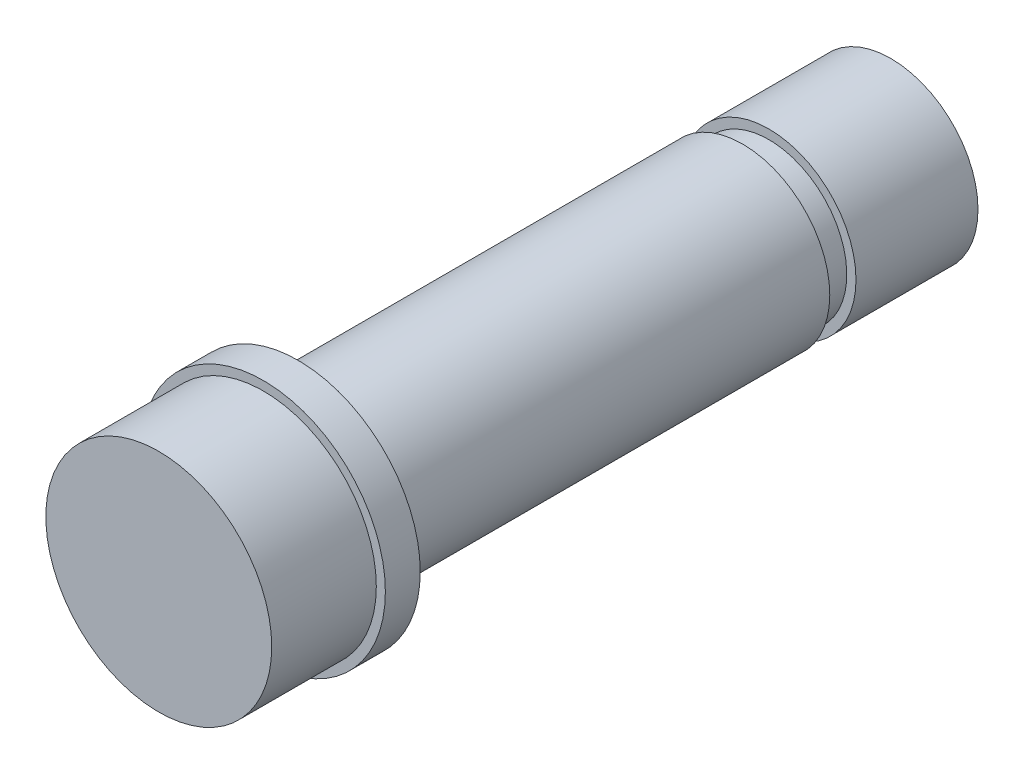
from build123d import *

# Parameters (mm, degrees)
SKETCH_2_017_W = 1.27
SKETCH_2_017_H = 2.1336
SKETCH3_W      = 2.3876
SKETCH3_H      = 0.83947


with BuildPart() as part:
    # Sketch1 → Revolve2 (revolve)
    with BuildSketch(Plane(origin=(0, 0, 0), x_dir=(0, 0, -1), z_dir=(1, 0, 0)), mode=Mode.PRIVATE) as revolve2_sk:
        Polygon((0, 7.9375), (0, 11.1125), (-3.175, 11.1125), (-3.175, 10.287), (-12.7, 10.287), (-12.7, 0), (-6.828558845, 0), (-3.048, 6.54812), (53.975, 6.54812), (53.975, 7.9375), align=None)
    revolve(revolve2_sk.sketch.rotate(Axis((0, 0, 0), (0, 0, -1)), 90), axis=Axis((0, 0, 0), (0, 0, -1)))

    # Sketch 2-017 → Cut-Revolve1 (revolve, cut)
    with BuildSketch(Plane(origin=(0, 0, 0), x_dir=(0, 0, -1), z_dir=(1, 0, 0)), mode=Mode.PRIVATE) as cut_revolve1_sk:
        with Locations((-0.635, 9.652)):
            Rectangle(SKETCH_2_017_W, SKETCH_2_017_H)
    revolve(cut_revolve1_sk.sketch.rotate(Axis((0, 0, 0), (0, 0, -1)), 90), axis=Axis((0, 0, 0), (0, 0, -1)), mode=Mode.SUBTRACT)

    # Sketch3 → Cut-Revolve3 (revolve, cut)
    with BuildSketch(Plane(origin=(0, 0, 0), x_dir=(0, 0, -1), z_dir=(1, 0, 0)), mode=Mode.PRIVATE) as cut_revolve3_sk:
        with Locations((41.6687, 7.517765)):
            Rectangle(SKETCH3_W, SKETCH3_H)
    revolve(cut_revolve3_sk.sketch.rotate(Axis((0, 0, 0), (0, 0, -1)), 90), axis=Axis((0, 0, 0), (0, 0, -1)), mode=Mode.SUBTRACT)


solid = part.part
